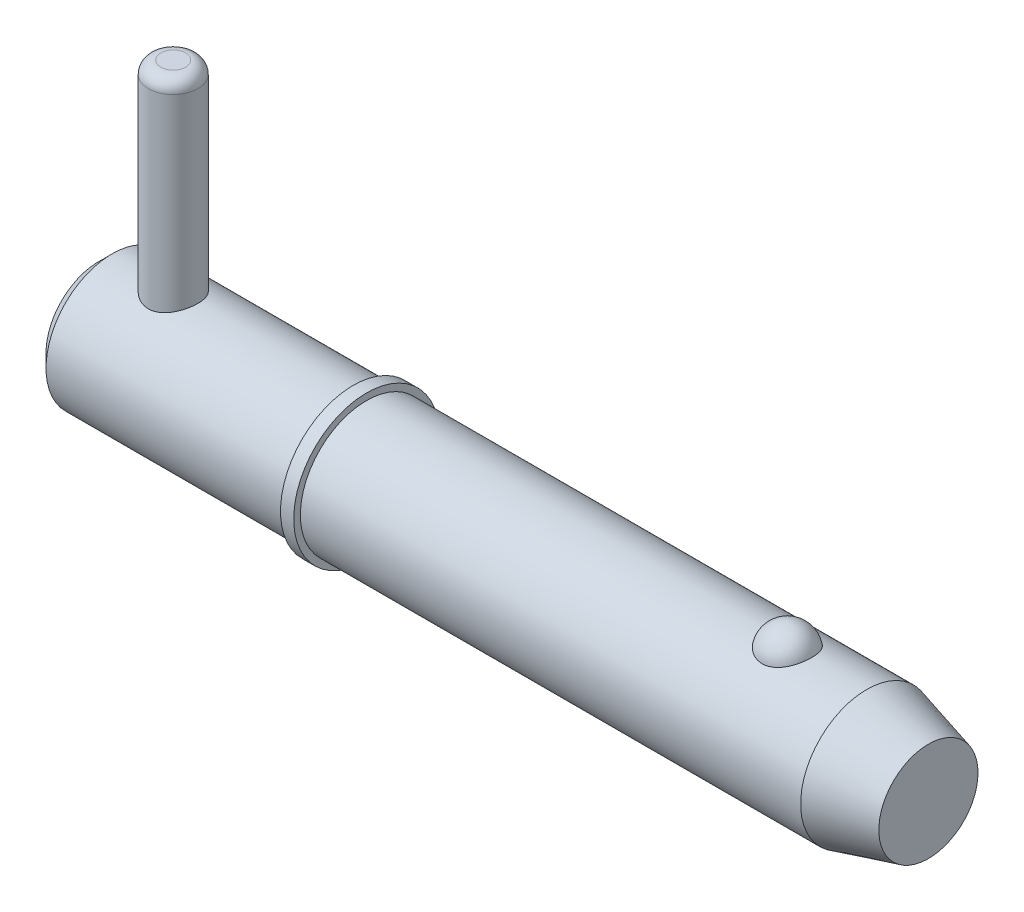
ISO-10303-21;
HEADER;
FILE_DESCRIPTION(('STEP AP214'),'2;1');
FILE_NAME('part.step','',(''),(''),'','','');
FILE_SCHEMA(('AUTOMOTIVE_DESIGN { 1 0 10303 214 1 1 1 1 }'));
ENDSEC;
DATA;
#1=APPLICATION_CONTEXT('core data for automotive mechanical design processes');
#2=APPLICATION_PROTOCOL_DEFINITION('international standard','automotive_design',2000,#1);
#3=PRODUCT_CONTEXT('',#1,'mechanical');
#4=PRODUCT('Part','Part','',(#3));
#5=PRODUCT_RELATED_PRODUCT_CATEGORY('part','',(#4));
#6=PRODUCT_DEFINITION_FORMATION('','',#4);
#7=PRODUCT_DEFINITION_CONTEXT('part definition',#1,'design');
#8=PRODUCT_DEFINITION('design','',#6,#7);
#9=PRODUCT_DEFINITION_SHAPE('','',#8);
#10=(LENGTH_UNIT() NAMED_UNIT(*) SI_UNIT(.MILLI.,.METRE.));
#11=(NAMED_UNIT(*) PLANE_ANGLE_UNIT() SI_UNIT($,.RADIAN.));
#12=(NAMED_UNIT(*) SI_UNIT($,.STERADIAN.) SOLID_ANGLE_UNIT());
#13=UNCERTAINTY_MEASURE_WITH_UNIT(LENGTH_MEASURE(1.E-05),#10,'distance_accuracy_value','');
#14=(GEOMETRIC_REPRESENTATION_CONTEXT(3) GLOBAL_UNCERTAINTY_ASSIGNED_CONTEXT((#13)) GLOBAL_UNIT_ASSIGNED_CONTEXT((#10,
#11,#12)) REPRESENTATION_CONTEXT('',''));
#15=CARTESIAN_POINT('',(0.,0.,0.));
#16=DIRECTION('',(0.,0.,1.));
#17=DIRECTION('',(1.,0.,0.));
#18=AXIS2_PLACEMENT_3D('',#15,#16,#17);
#19=CARTESIAN_POINT('',(7.14,25.4,0.));
#20=DIRECTION('',(0.,-1.,0.));
#21=DIRECTION('',(0.,0.,-1.));
#22=AXIS2_PLACEMENT_3D('',#19,#20,#21);
#23=CYLINDRICAL_SURFACE('',#22,2.38);
#24=CARTESIAN_POINT('',(7.14,-5.16,0.));
#25=DIRECTION('',(0.,1.,0.));
#26=DIRECTION('',(0.,0.,1.));
#27=AXIS2_PLACEMENT_3D('',#24,#25,#26);
#28=CIRCLE('',#27,2.38);
#29=CARTESIAN_POINT('',(7.14,-5.16,2.38));
#30=VERTEX_POINT('',#29);
#31=EDGE_CURVE('P0_E25',#30,#30,#28,.T.);
#32=ORIENTED_EDGE('',*,*,#31,.T.);
#33=EDGE_LOOP('',(#32));
#34=FACE_BOUND('',#33,.T.);
#35=CARTESIAN_POINT('',(7.14,24.21,0.));
#36=DIRECTION('',(0.,1.,0.));
#37=DIRECTION('',(0.,0.,1.));
#38=AXIS2_PLACEMENT_3D('',#35,#36,#37);
#39=CIRCLE('',#38,2.38);
#40=CARTESIAN_POINT('',(7.14,24.21,2.38));
#41=VERTEX_POINT('',#40);
#42=EDGE_CURVE('P0_E29',#41,#41,#39,.F.);
#43=ORIENTED_EDGE('',*,*,#42,.T.);
#44=EDGE_LOOP('',(#43));
#45=FACE_BOUND('',#44,.T.);
#46=ADVANCED_FACE('P0_F14',(#34,#45),#23,.T.);
#47=CARTESIAN_POINT('',(7.14,25.4,0.));
#48=DIRECTION('',(0.,1.,0.));
#49=DIRECTION('',(0.,0.,1.));
#50=AXIS2_PLACEMENT_3D('',#47,#48,#49);
#51=PLANE('',#50);
#52=CARTESIAN_POINT('',(7.14,25.4,0.));
#53=DIRECTION('',(0.,1.,0.));
#54=DIRECTION('',(0.,0.,1.));
#55=AXIS2_PLACEMENT_3D('',#52,#53,#54);
#56=CIRCLE('',#55,1.19);
#57=CARTESIAN_POINT('',(7.14,25.4,1.19));
#58=VERTEX_POINT('',#57);
#59=EDGE_CURVE('P0_E10',#58,#58,#56,.T.);
#60=ORIENTED_EDGE('',*,*,#59,.T.);
#61=EDGE_LOOP('',(#60));
#62=FACE_BOUND('',#61,.T.);
#63=ADVANCED_FACE('P0_F46',(#62),#51,.T.);
#64=CARTESIAN_POINT('',(7.14,-6.35,0.));
#65=DIRECTION('',(0.,1.,0.));
#66=DIRECTION('',(0.,0.,1.));
#67=AXIS2_PLACEMENT_3D('',#64,#65,#66);
#68=PLANE('',#67);
#69=CARTESIAN_POINT('',(7.14,-6.35,0.));
#70=DIRECTION('',(0.,1.,0.));
#71=DIRECTION('',(0.,0.,1.));
#72=AXIS2_PLACEMENT_3D('',#69,#70,#71);
#73=CIRCLE('',#72,1.19);
#74=CARTESIAN_POINT('',(7.14,-6.35,1.19));
#75=VERTEX_POINT('',#74);
#76=EDGE_CURVE('P0_E21',#75,#75,#73,.F.);
#77=ORIENTED_EDGE('',*,*,#76,.T.);
#78=EDGE_LOOP('',(#77));
#79=FACE_BOUND('',#78,.T.);
#80=ADVANCED_FACE('P0_F43',(#79),#68,.F.);
#81=CARTESIAN_POINT('',(7.14,-5.16,0.));
#82=DIRECTION('',(0.,1.,0.));
#83=DIRECTION('',(0.,0.,1.));
#84=AXIS2_PLACEMENT_3D('',#81,#82,#83);
#85=DEGENERATE_TOROIDAL_SURFACE('',#84,1.19,1.19,.T.);
#86=ORIENTED_EDGE('',*,*,#76,.F.);
#87=EDGE_LOOP('',(#86));
#88=FACE_BOUND('',#87,.T.);
#89=ORIENTED_EDGE('',*,*,#31,.F.);
#90=EDGE_LOOP('',(#89));
#91=FACE_BOUND('',#90,.T.);
#92=ADVANCED_FACE('P0_F38',(#88,#91),#85,.T.);
#93=CARTESIAN_POINT('',(7.14,24.21,0.));
#94=DIRECTION('',(0.,1.,0.));
#95=DIRECTION('',(0.,0.,1.));
#96=AXIS2_PLACEMENT_3D('',#93,#94,#95);
#97=DEGENERATE_TOROIDAL_SURFACE('',#96,1.19,1.19,.T.);
#98=ORIENTED_EDGE('',*,*,#42,.F.);
#99=EDGE_LOOP('',(#98));
#100=FACE_BOUND('',#99,.T.);
#101=ORIENTED_EDGE('',*,*,#59,.F.);
#102=EDGE_LOOP('',(#101));
#103=FACE_BOUND('',#102,.T.);
#104=ADVANCED_FACE('P0_F16',(#100,#103),#97,.T.);
#105=CLOSED_SHELL('',(#46,#63,#80,#92,#104));
#106=MANIFOLD_SOLID_BREP('P0_B1',#105);
#107=CARTESIAN_POINT('',(0.,0.,0.));
#108=DIRECTION('',(1.,0.,0.));
#109=DIRECTION('',(0.,0.,-1.));
#110=AXIS2_PLACEMENT_3D('',#107,#108,#109);
#111=CYLINDRICAL_SURFACE('',#110,6.35);
#112=CARTESIAN_POINT('',(73.7553693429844,0.,0.));
#113=DIRECTION('',(1.,0.,0.));
#114=DIRECTION('',(0.,0.,-1.));
#115=AXIS2_PLACEMENT_3D('',#112,#113,#114);
#116=CIRCLE('',#115,6.35);
#117=CARTESIAN_POINT('',(73.7553693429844,0.,-6.35));
#118=VERTEX_POINT('',#117);
#119=EDGE_CURVE('P1_E81',#118,#118,#116,.T.);
#120=ORIENTED_EDGE('',*,*,#119,.F.);
#121=EDGE_LOOP('',(#120));
#122=FACE_BOUND('',#121,.T.);
#123=CARTESIAN_POINT('',(25.7,0.,0.));
#124=DIRECTION('',(1.,0.,0.));
#125=DIRECTION('',(0.,0.,-1.));
#126=AXIS2_PLACEMENT_3D('',#123,#124,#125);
#127=CIRCLE('',#126,6.35);
#128=CARTESIAN_POINT('',(25.7,0.,-6.35));
#129=VERTEX_POINT('',#128);
#130=EDGE_CURVE('P1_E85',#129,#129,#127,.T.);
#131=ORIENTED_EDGE('',*,*,#130,.T.);
#132=EDGE_LOOP('',(#131));
#133=FACE_BOUND('',#132,.T.);
#134=CARTESIAN_POINT('',(66.1300214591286,5.87502187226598,2.40969251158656));
#135=CARTESIAN_POINT('',(66.0050305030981,5.87501645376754,2.40969773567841));
#136=CARTESIAN_POINT('',(65.8800806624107,5.87916061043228,2.39967292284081));
#137=CARTESIAN_POINT('',(65.6339091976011,5.89523112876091,2.35991730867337));
#138=CARTESIAN_POINT('',(65.5126863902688,5.90715499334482,2.33019283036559));
#139=CARTESIAN_POINT('',(65.2775170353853,5.9373956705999,2.25201402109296));
#140=CARTESIAN_POINT('',(65.1635602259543,5.95570321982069,2.20358681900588));
#141=CARTESIAN_POINT('',(64.94557352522,5.99672067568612,2.08937987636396));
#142=CARTESIAN_POINT('',(64.8415457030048,6.01943149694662,2.02359652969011));
#143=CARTESIAN_POINT('',(64.6429437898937,6.06760647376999,1.87428969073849));
#144=CARTESIAN_POINT('',(64.5487268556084,6.09313095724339,1.79031110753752));
#145=CARTESIAN_POINT('',(64.3752557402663,6.14375873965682,1.60800178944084));
#146=CARTESIAN_POINT('',(64.2960043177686,6.16886196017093,1.50966841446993));
#147=CARTESIAN_POINT('',(64.1508457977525,6.2172460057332,1.29645884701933));
#148=CARTESIAN_POINT('',(64.0856885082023,6.24039621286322,1.18104158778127));
#149=CARTESIAN_POINT('',(63.9747035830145,6.28117277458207,0.940351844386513));
#150=CARTESIAN_POINT('',(63.9288776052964,6.29879865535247,0.815078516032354));
#151=CARTESIAN_POINT('',(63.8570234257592,6.32692073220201,0.556494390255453));
#152=CARTESIAN_POINT('',(63.831249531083,6.33732517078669,0.423102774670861));
#153=CARTESIAN_POINT('',(63.8009885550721,6.34957673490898,0.153542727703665));
#154=CARTESIAN_POINT('',(63.7965009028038,6.35142408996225,0.017374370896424));
#155=CARTESIAN_POINT('',(63.8088655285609,6.34638925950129,-0.253036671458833));
#156=CARTESIAN_POINT('',(63.8255949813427,6.33955731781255,-0.387285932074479));
#157=CARTESIAN_POINT('',(63.879843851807,6.31794129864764,-0.650851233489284));
#158=CARTESIAN_POINT('',(63.9173636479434,6.30315707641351,-0.7801671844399));
#159=CARTESIAN_POINT('',(64.012500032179,6.26711642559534,-1.03041949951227));
#160=CARTESIAN_POINT('',(64.070143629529,6.24585130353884,-1.1513443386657));
#161=CARTESIAN_POINT('',(64.2043522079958,6.19905619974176,-1.38129800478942));
#162=CARTESIAN_POINT('',(64.2809187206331,6.17352587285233,-1.49032586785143));
#163=CARTESIAN_POINT('',(64.4517538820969,6.12080227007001,-1.69393164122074));
#164=CARTESIAN_POINT('',(64.5461008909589,6.09360200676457,-1.78844209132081));
#165=CARTESIAN_POINT('',(64.7501196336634,6.0407043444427,-1.95970536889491));
#166=CARTESIAN_POINT('',(64.8597900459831,6.01500681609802,-2.03645972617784));
#167=CARTESIAN_POINT('',(65.0891876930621,5.96867714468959,-2.16845644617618));
#168=CARTESIAN_POINT('',(65.2086522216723,5.94794910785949,-2.22412062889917));
#169=CARTESIAN_POINT('',(65.4562188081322,5.91340580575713,-2.31440992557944));
#170=CARTESIAN_POINT('',(65.5843175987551,5.89958794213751,-2.34904294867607));
#171=CARTESIAN_POINT('',(65.838582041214,5.88111049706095,-2.39491590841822));
#172=CARTESIAN_POINT('',(65.9645207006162,5.87602512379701,-2.40724512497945));
#173=CARTESIAN_POINT('',(66.2167867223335,5.87428980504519,-2.41147867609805));
#174=CARTESIAN_POINT('',(66.343114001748,5.87763817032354,-2.40338710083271));
#175=CARTESIAN_POINT('',(66.5884170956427,5.89212921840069,-2.36762715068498));
#176=CARTESIAN_POINT('',(66.7074992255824,5.90302431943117,-2.34058030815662));
#177=CARTESIAN_POINT('',(66.9392447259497,5.93113752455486,-2.2683906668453));
#178=CARTESIAN_POINT('',(67.0519075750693,5.94835614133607,-2.22324640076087));
#179=CARTESIAN_POINT('',(67.2704009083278,5.98773016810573,-2.11493806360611));
#180=CARTESIAN_POINT('',(67.376028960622,6.00998499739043,-2.05140269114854));
#181=CARTESIAN_POINT('',(67.5753006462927,6.0569014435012,-1.90842705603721));
#182=CARTESIAN_POINT('',(67.6689415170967,6.08156361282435,-1.82898313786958));
#183=CARTESIAN_POINT('',(67.8466754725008,6.13211715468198,-1.6518242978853));
#184=CARTESIAN_POINT('',(67.930055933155,6.15800825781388,-1.55339381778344));
#185=CARTESIAN_POINT('',(68.0797900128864,6.20712834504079,-1.34374214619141));
#186=CARTESIAN_POINT('',(68.1461405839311,6.23035685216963,-1.23251867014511));
#187=CARTESIAN_POINT('',(68.2623455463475,6.27251177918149,-0.996447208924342));
#188=CARTESIAN_POINT('',(68.3116072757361,6.29127762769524,-0.8712781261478));
#189=CARTESIAN_POINT('',(68.3896142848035,6.3215862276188,-0.613870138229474));
#190=CARTESIAN_POINT('',(68.4183593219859,6.33312889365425,-0.481631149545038));
#191=CARTESIAN_POINT('',(68.4547705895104,6.34782349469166,-0.213672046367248));
#192=CARTESIAN_POINT('',(68.4624134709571,6.35096613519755,-0.077948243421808));
#193=CARTESIAN_POINT('',(68.4563951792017,6.34851322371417,0.192943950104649));
#194=CARTESIAN_POINT('',(68.4427343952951,6.3429178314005,0.328112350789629));
#195=CARTESIAN_POINT('',(68.3945036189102,6.32360512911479,0.593406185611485));
#196=CARTESIAN_POINT('',(68.3600313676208,6.30992579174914,0.723552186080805));
#197=CARTESIAN_POINT('',(68.2709539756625,6.27586325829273,0.975834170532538));
#198=CARTESIAN_POINT('',(68.2163476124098,6.25547965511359,1.09796966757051));
#199=CARTESIAN_POINT('',(68.0877587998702,6.20998183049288,1.33148921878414));
#200=CARTESIAN_POINT('',(68.0136742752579,6.18484288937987,1.44281227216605));
#201=CARTESIAN_POINT('',(67.8478204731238,6.13258735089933,1.65087683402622));
#202=CARTESIAN_POINT('',(67.7560515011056,6.10547078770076,1.74761859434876));
#203=CARTESIAN_POINT('',(67.5571839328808,6.05235879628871,1.92350926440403));
#204=CARTESIAN_POINT('',(67.450133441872,6.02636017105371,2.00271146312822));
#205=CARTESIAN_POINT('',(67.2231384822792,5.97843747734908,2.14154159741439));
#206=CARTESIAN_POINT('',(67.103191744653,5.95651412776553,2.2011660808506));
#207=CARTESIAN_POINT('',(66.8445236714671,5.91812106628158,2.30250570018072));
#208=CARTESIAN_POINT('',(66.7050698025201,5.90217533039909,2.34256795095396));
#209=CARTESIAN_POINT('',(66.4203974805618,5.88063128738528,2.39615214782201));
#210=CARTESIAN_POINT('',(66.2751817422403,5.87502816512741,2.40968644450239));
#211=CARTESIAN_POINT('',(66.1300214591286,5.87502187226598,2.40969251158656));
#212=B_SPLINE_CURVE_WITH_KNOTS('',3,(#134,#135,#136,#137,#138,#139,#140,#141,#142,#143,#144,
#145,#146,#147,#148,#149,#150,#151,#152,#153,#154,#155,#156,#157,#158,#159,#160,#161,#162,#163,
#164,#165,#166,#167,#168,#169,#170,#171,#172,#173,#174,#175,#176,#177,#178,#179,#180,#181,#182,
#183,#184,#185,#186,#187,#188,#189,#190,#191,#192,#193,#194,#195,#196,#197,#198,#199,#200,#201,
#202,#203,#204,#205,#206,#207,#208,#209,#210,#211),.UNSPECIFIED.,.T.,.F.,(4,2,2,2,2,2,2,2,2,2,2,
2,2,2,2,2,2,2,2,2,2,2,2,2,2,2,2,2,2,2,2,2,2,2,2,2,2,2,4),(0.,0.374440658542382,
0.748761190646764,1.12254078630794,1.49639810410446,1.88098871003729,2.26565013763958,
2.66741104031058,3.0692063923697,3.47601794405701,3.88281858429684,4.28727498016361,
4.69173873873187,5.09674745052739,5.50178895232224,5.90865911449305,6.31549420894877,
6.71369855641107,7.11175305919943,7.48978077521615,7.86773278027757,8.23383886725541,
8.59997464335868,8.97409044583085,9.34829231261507,9.74122667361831,10.1342313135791,
10.539752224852,10.945277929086,11.3512521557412,11.7572189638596,12.1612938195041,
12.5653932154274,12.9716540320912,13.37790783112,13.782909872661,14.1879832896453,
14.6230486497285,15.0579114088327),.UNSPECIFIED.);
#213=CARTESIAN_POINT('',(66.1300214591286,5.87502187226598,2.40969251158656));
#214=VERTEX_POINT('',#213);
#215=EDGE_CURVE('P1_E35',#214,#214,#212,.T.);
#216=ORIENTED_EDGE('',*,*,#215,.T.);
#217=EDGE_LOOP('',(#216));
#218=FACE_BOUND('',#217,.T.);
#219=ADVANCED_FACE('P1_F13',(#122,#133,#218),#111,.T.);
#220=CARTESIAN_POINT('',(0.,0.,0.));
#221=DIRECTION('',(-1.,0.,0.));
#222=DIRECTION('',(0.,0.,1.));
#223=AXIS2_PLACEMENT_3D('',#220,#221,#222);
#224=PLANE('',#223);
#225=CARTESIAN_POINT('',(0.,0.,0.));
#226=DIRECTION('',(1.,0.,0.));
#227=DIRECTION('',(0.,0.,-1.));
#228=AXIS2_PLACEMENT_3D('',#225,#226,#227);
#229=CIRCLE('',#228,5.08);
#230=CARTESIAN_POINT('',(0.,0.,-5.08));
#231=VERTEX_POINT('',#230);
#232=EDGE_CURVE('P1_E9',#231,#231,#229,.T.);
#233=ORIENTED_EDGE('',*,*,#232,.F.);
#234=EDGE_LOOP('',(#233));
#235=FACE_BOUND('',#234,.T.);
#236=ADVANCED_FACE('P1_F15',(#235),#224,.T.);
#237=CARTESIAN_POINT('',(1.27,0.,0.));
#238=DIRECTION('',(1.,0.,0.));
#239=DIRECTION('',(0.,0.,-1.));
#240=AXIS2_PLACEMENT_3D('',#237,#238,#239);
#241=CONICAL_SURFACE('',#240,6.35,0.78539816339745);
#242=ORIENTED_EDGE('',*,*,#232,.T.);
#243=EDGE_LOOP('',(#242));
#244=FACE_BOUND('',#243,.T.);
#245=CARTESIAN_POINT('',(1.27,0.,0.));
#246=DIRECTION('',(1.,0.,0.));
#247=DIRECTION('',(0.,0.,-1.));
#248=AXIS2_PLACEMENT_3D('',#245,#246,#247);
#249=CIRCLE('',#248,6.35);
#250=CARTESIAN_POINT('',(1.27,0.,-6.35));
#251=VERTEX_POINT('',#250);
#252=EDGE_CURVE('P1_E26',#251,#251,#249,.T.);
#253=ORIENTED_EDGE('',*,*,#252,.F.);
#254=EDGE_LOOP('',(#253));
#255=FACE_BOUND('',#254,.T.);
#256=ADVANCED_FACE('P1_F77',(#244,#255),#241,.T.);
#257=CARTESIAN_POINT('',(0.,0.,0.));
#258=DIRECTION('',(1.,0.,0.));
#259=DIRECTION('',(0.,0.,-1.));
#260=AXIS2_PLACEMENT_3D('',#257,#258,#259);
#261=CYLINDRICAL_SURFACE('',#260,6.35);
#262=CARTESIAN_POINT('',(7.14,-5.88711304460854,2.38));
#263=CARTESIAN_POINT('',(7.01146258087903,-5.88710856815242,2.38000480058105));
#264=CARTESIAN_POINT('',(6.88295682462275,-5.89136840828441,2.36955244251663));
#265=CARTESIAN_POINT('',(6.62981934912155,-5.90782785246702,2.32820953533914));
#266=CARTESIAN_POINT('',(6.50518751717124,-5.92002722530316,2.29731958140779));
#267=CARTESIAN_POINT('',(6.26352403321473,-5.95079384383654,2.21639366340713));
#268=CARTESIAN_POINT('',(6.14647496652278,-5.96934583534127,2.16640353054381));
#269=CARTESIAN_POINT('',(5.92237941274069,-6.01070278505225,2.04885862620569));
#270=CARTESIAN_POINT('',(5.81533593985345,-6.03350901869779,1.98129858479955));
#271=CARTESIAN_POINT('',(5.60897525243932,-6.08207341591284,1.82693902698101));
#272=CARTESIAN_POINT('',(5.51022503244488,-6.10791836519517,1.73940861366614));
#273=CARTESIAN_POINT('',(5.32840561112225,-6.15892405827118,1.54914379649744));
#274=CARTESIAN_POINT('',(5.24533975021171,-6.1840846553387,1.44640616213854));
#275=CARTESIAN_POINT('',(5.09451639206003,-6.23191821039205,1.22434014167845));
#276=CARTESIAN_POINT('',(5.02737511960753,-6.25447755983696,1.10456656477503));
#277=CARTESIAN_POINT('',(4.91443001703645,-6.2935236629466,0.854429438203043));
#278=CARTESIAN_POINT('',(4.86861879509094,-6.31001251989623,0.724069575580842));
#279=CARTESIAN_POINT('',(4.80162253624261,-6.33444370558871,0.46242122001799));
#280=CARTESIAN_POINT('',(4.77946137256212,-6.34272370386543,0.331414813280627));
#281=CARTESIAN_POINT('',(4.75726677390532,-6.35101600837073,0.0672982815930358));
#282=CARTESIAN_POINT('',(4.75722615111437,-6.35103100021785,-0.0658111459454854));
#283=CARTESIAN_POINT('',(4.77870510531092,-6.3430064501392,-0.323358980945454));
#284=CARTESIAN_POINT('',(4.79915922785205,-6.33536494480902,-0.447900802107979));
#285=CARTESIAN_POINT('',(4.85925493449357,-6.31340794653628,-0.69163609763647));
#286=CARTESIAN_POINT('',(4.89889787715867,-6.29909198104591,-0.810829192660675));
#287=CARTESIAN_POINT('',(4.9967414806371,-6.26494471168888,-1.04254212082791));
#288=CARTESIAN_POINT('',(5.05520370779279,-6.24503620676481,-1.1549396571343));
#289=CARTESIAN_POINT('',(5.1887948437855,-6.20171869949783,-1.3686079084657));
#290=CARTESIAN_POINT('',(5.26392912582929,-6.17830856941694,-1.46987502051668));
#291=CARTESIAN_POINT('',(5.43386591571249,-6.12878580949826,-1.66468415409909));
#292=CARTESIAN_POINT('',(5.52956139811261,-6.10259519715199,-1.75742857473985));
#293=CARTESIAN_POINT('',(5.73530435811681,-6.05155777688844,-1.92585331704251));
#294=CARTESIAN_POINT('',(5.84535542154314,-6.02671130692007,-2.00152936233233));
#295=CARTESIAN_POINT('',(6.07982989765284,-5.98068420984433,-2.13519109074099));
#296=CARTESIAN_POINT('',(6.20451768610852,-5.95959698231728,-2.19274775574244));
#297=CARTESIAN_POINT('',(6.4628145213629,-5.92455622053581,-2.28574558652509));
#298=CARTESIAN_POINT('',(6.59641856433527,-5.91059872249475,-2.32119904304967));
#299=CARTESIAN_POINT('',(6.86087441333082,-5.8923327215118,-2.36717069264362));
#300=CARTESIAN_POINT('',(6.99147192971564,-5.8875347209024,-2.37895573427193));
#301=CARTESIAN_POINT('',(7.25283805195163,-5.88674545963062,-2.38091046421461));
#302=CARTESIAN_POINT('',(7.38360660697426,-5.89075200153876,-2.37108554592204));
#303=CARTESIAN_POINT('',(7.63510696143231,-5.90662331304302,-2.33124781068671));
#304=CARTESIAN_POINT('',(7.75602069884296,-5.91810660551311,-2.30221396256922));
#305=CARTESIAN_POINT('',(7.99120505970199,-5.94718527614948,-2.22601401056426));
#306=CARTESIAN_POINT('',(8.10547431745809,-5.96478190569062,-2.17884419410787));
#307=CARTESIAN_POINT('',(8.32888632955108,-6.00491533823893,-2.06572311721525));
#308=CARTESIAN_POINT('',(8.43767672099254,-6.02761250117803,-1.99913452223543));
#309=CARTESIAN_POINT('',(8.6429894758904,-6.07511988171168,-1.84974438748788));
#310=CARTESIAN_POINT('',(8.73950733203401,-6.09993087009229,-1.76693691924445));
#311=CARTESIAN_POINT('',(8.9238741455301,-6.1507686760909,-1.58125563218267));
#312=CARTESIAN_POINT('',(9.01078732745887,-6.17677301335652,-1.47744327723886));
#313=CARTESIAN_POINT('',(9.16607127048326,-6.22556172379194,-1.25606967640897));
#314=CARTESIAN_POINT('',(9.23444197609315,-6.24834608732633,-1.13850838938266));
#315=CARTESIAN_POINT('',(9.3502493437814,-6.28811144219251,-0.893050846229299));
#316=CARTESIAN_POINT('',(9.39775808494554,-6.30511236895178,-0.765192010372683));
#317=CARTESIAN_POINT('',(9.47032640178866,-6.33145833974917,-0.502514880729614));
#318=CARTESIAN_POINT('',(9.49539651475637,-6.34080697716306,-0.367699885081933));
#319=CARTESIAN_POINT('',(9.52124059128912,-6.35045496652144,-0.103396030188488));
#320=CARTESIAN_POINT('',(9.52334421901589,-6.35124952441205,0.025945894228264));
#321=CARTESIAN_POINT('',(9.50661518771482,-6.34499064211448,0.283061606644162));
#322=CARTESIAN_POINT('',(9.48778504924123,-6.33793814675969,0.410835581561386));
#323=CARTESIAN_POINT('',(9.43065630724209,-6.31700307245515,0.658028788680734));
#324=CARTESIAN_POINT('',(9.39284291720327,-6.30329098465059,0.7775756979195));
#325=CARTESIAN_POINT('',(9.29930406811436,-6.27046903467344,1.00863789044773));
#326=CARTESIAN_POINT('',(9.2435752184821,-6.25135815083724,1.12015164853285));
#327=CARTESIAN_POINT('',(9.11312349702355,-6.20865254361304,1.33711407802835));
#328=CARTESIAN_POINT('',(9.03770094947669,-6.18490316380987,1.44211105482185));
#329=CARTESIAN_POINT('',(8.87110640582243,-6.13583718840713,1.63836897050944));
#330=CARTESIAN_POINT('',(8.77992879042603,-6.11052003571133,1.72962498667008));
#331=CARTESIAN_POINT('',(8.57869799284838,-6.05953829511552,1.90076098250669));
#332=CARTESIAN_POINT('',(8.46790320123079,-6.03392573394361,1.97978778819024));
#333=CARTESIAN_POINT('',(8.23379693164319,-5.98676607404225,2.11813466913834));
#334=CARTESIAN_POINT('',(8.11048418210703,-5.9652193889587,2.17745273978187));
#335=CARTESIAN_POINT('',(7.84900037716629,-5.92818393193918,2.27641807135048));
#336=CARTESIAN_POINT('',(7.71041678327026,-5.91299857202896,2.31510015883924));
#337=CARTESIAN_POINT('',(7.42787316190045,-5.89246887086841,2.36688002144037));
#338=CARTESIAN_POINT('',(7.28391673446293,-5.88711805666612,2.37999462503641));
#339=CARTESIAN_POINT('',(7.14,-5.88711304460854,2.38));
#340=B_SPLINE_CURVE_WITH_KNOTS('',3,(#262,#263,#264,#265,#266,#267,#268,#269,#270,#271,#272,
#273,#274,#275,#276,#277,#278,#279,#280,#281,#282,#283,#284,#285,#286,#287,#288,#289,#290,#291,
#292,#293,#294,#295,#296,#297,#298,#299,#300,#301,#302,#303,#304,#305,#306,#307,#308,#309,#310,
#311,#312,#313,#314,#315,#316,#317,#318,#319,#320,#321,#322,#323,#324,#325,#326,#327,#328,#329,
#330,#331,#332,#333,#334,#335,#336,#337,#338,#339),.UNSPECIFIED.,.T.,.F.,(4,2,2,2,2,2,2,2,2,2,2,
2,2,2,2,2,2,2,2,2,2,2,2,2,2,2,2,2,2,2,2,2,2,2,2,2,2,2,4),(0.,0.385076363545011,
0.770141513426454,1.15428843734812,1.53855071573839,1.94016118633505,2.3418570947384,
2.75720522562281,3.1724093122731,3.569721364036,3.96690431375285,4.34445758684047,
4.72203759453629,5.10511017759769,5.48830640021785,5.89390240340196,6.29959991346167,
6.71428455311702,7.12873839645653,7.52034494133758,7.91185376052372,8.28480528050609,
8.65783318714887,9.0448340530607,9.43197664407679,9.84363087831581,10.2552863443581,
10.6655081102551,11.0755371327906,11.4616919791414,11.847800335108,12.224507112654,
12.6012852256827,12.9938941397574,13.386643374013,13.8000944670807,14.2135876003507,
14.6450218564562,15.0761720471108),.UNSPECIFIED.);
#341=CARTESIAN_POINT('',(7.14,-5.88711304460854,2.38));
#342=VERTEX_POINT('',#341);
#343=EDGE_CURVE('P1_E17',#342,#342,#340,.T.);
#344=ORIENTED_EDGE('',*,*,#343,.F.);
#345=EDGE_LOOP('',(#344));
#346=FACE_BOUND('',#345,.T.);
#347=CARTESIAN_POINT('',(7.14,5.88711304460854,2.38));
#348=CARTESIAN_POINT('',(7.26853741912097,5.88710856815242,2.38000480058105));
#349=CARTESIAN_POINT('',(7.39704317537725,5.89136840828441,2.36955244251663));
#350=CARTESIAN_POINT('',(7.65018065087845,5.90782785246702,2.32820953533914));
#351=CARTESIAN_POINT('',(7.77481248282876,5.92002722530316,2.29731958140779));
#352=CARTESIAN_POINT('',(8.01647596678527,5.95079384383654,2.21639366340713));
#353=CARTESIAN_POINT('',(8.13352503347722,5.96934583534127,2.16640353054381));
#354=CARTESIAN_POINT('',(8.35762058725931,6.01070278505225,2.04885862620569));
#355=CARTESIAN_POINT('',(8.46466406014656,6.03350901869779,1.98129858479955));
#356=CARTESIAN_POINT('',(8.67102474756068,6.08207341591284,1.82693902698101));
#357=CARTESIAN_POINT('',(8.76977496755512,6.10791836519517,1.73940861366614));
#358=CARTESIAN_POINT('',(8.95159438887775,6.15892405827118,1.54914379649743));
#359=CARTESIAN_POINT('',(9.03466024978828,6.1840846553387,1.44640616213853));
#360=CARTESIAN_POINT('',(9.18548360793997,6.23191821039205,1.22434014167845));
#361=CARTESIAN_POINT('',(9.25262488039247,6.25447755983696,1.10456656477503));
#362=CARTESIAN_POINT('',(9.36556998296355,6.2935236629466,0.854429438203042));
#363=CARTESIAN_POINT('',(9.41138120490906,6.31001251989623,0.72406957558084));
#364=CARTESIAN_POINT('',(9.47837746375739,6.33444370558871,0.462421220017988));
#365=CARTESIAN_POINT('',(9.50053862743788,6.34272370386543,0.331414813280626));
#366=CARTESIAN_POINT('',(9.52273322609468,6.35101600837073,0.0672982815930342));
#367=CARTESIAN_POINT('',(9.52277384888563,6.35103100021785,-0.0658111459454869));
#368=CARTESIAN_POINT('',(9.50129489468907,6.3430064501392,-0.323358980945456));
#369=CARTESIAN_POINT('',(9.48084077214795,6.33536494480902,-0.447900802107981));
#370=CARTESIAN_POINT('',(9.42074506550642,6.31340794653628,-0.691636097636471));
#371=CARTESIAN_POINT('',(9.38110212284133,6.29909198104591,-0.810829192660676));
#372=CARTESIAN_POINT('',(9.2832585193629,6.26494471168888,-1.04254212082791));
#373=CARTESIAN_POINT('',(9.22479629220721,6.24503620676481,-1.1549396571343));
#374=CARTESIAN_POINT('',(9.0912051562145,6.20171869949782,-1.3686079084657));
#375=CARTESIAN_POINT('',(9.0160708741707,6.17830856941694,-1.46987502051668));
#376=CARTESIAN_POINT('',(8.84613408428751,6.12878580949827,-1.66468415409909));
#377=CARTESIAN_POINT('',(8.75043860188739,6.10259519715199,-1.75742857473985));
#378=CARTESIAN_POINT('',(8.54469564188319,6.05155777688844,-1.92585331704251));
#379=CARTESIAN_POINT('',(8.43464457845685,6.02671130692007,-2.00152936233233));
#380=CARTESIAN_POINT('',(8.20017010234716,5.98068420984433,-2.13519109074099));
#381=CARTESIAN_POINT('',(8.07548231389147,5.95959698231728,-2.19274775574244));
#382=CARTESIAN_POINT('',(7.8171854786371,5.9245562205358,-2.28574558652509));
#383=CARTESIAN_POINT('',(7.68358143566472,5.91059872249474,-2.32119904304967));
#384=CARTESIAN_POINT('',(7.41912558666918,5.8923327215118,-2.36717069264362));
#385=CARTESIAN_POINT('',(7.28852807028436,5.8875347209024,-2.37895573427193));
#386=CARTESIAN_POINT('',(7.02716194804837,5.88674545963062,-2.38091046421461));
#387=CARTESIAN_POINT('',(6.89639339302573,5.89075200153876,-2.37108554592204));
#388=CARTESIAN_POINT('',(6.64489303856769,5.90662331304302,-2.33124781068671));
#389=CARTESIAN_POINT('',(6.52397930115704,5.91810660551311,-2.30221396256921));
#390=CARTESIAN_POINT('',(6.288794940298,5.94718527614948,-2.22601401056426));
#391=CARTESIAN_POINT('',(6.17452568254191,5.96478190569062,-2.17884419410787));
#392=CARTESIAN_POINT('',(5.95111367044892,6.00491533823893,-2.06572311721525));
#393=CARTESIAN_POINT('',(5.84232327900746,6.02761250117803,-1.99913452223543));
#394=CARTESIAN_POINT('',(5.6370105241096,6.07511988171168,-1.84974438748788));
#395=CARTESIAN_POINT('',(5.54049266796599,6.09993087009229,-1.76693691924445));
#396=CARTESIAN_POINT('',(5.3561258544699,6.1507686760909,-1.58125563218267));
#397=CARTESIAN_POINT('',(5.26921267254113,6.17677301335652,-1.47744327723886));
#398=CARTESIAN_POINT('',(5.11392872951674,6.22556172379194,-1.25606967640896));
#399=CARTESIAN_POINT('',(5.04555802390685,6.24834608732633,-1.13850838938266));
#400=CARTESIAN_POINT('',(4.9297506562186,6.28811144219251,-0.893050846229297));
#401=CARTESIAN_POINT('',(4.88224191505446,6.30511236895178,-0.76519201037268));
#402=CARTESIAN_POINT('',(4.80967359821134,6.33145833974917,-0.502514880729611));
#403=CARTESIAN_POINT('',(4.78460348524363,6.34080697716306,-0.36769988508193));
#404=CARTESIAN_POINT('',(4.75875940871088,6.35045496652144,-0.103396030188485));
#405=CARTESIAN_POINT('',(4.75665578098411,6.35124952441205,0.025945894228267));
#406=CARTESIAN_POINT('',(4.77338481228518,6.34499064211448,0.283061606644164));
#407=CARTESIAN_POINT('',(4.79221495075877,6.33793814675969,0.410835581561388));
#408=CARTESIAN_POINT('',(4.84934369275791,6.31700307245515,0.658028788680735));
#409=CARTESIAN_POINT('',(4.88715708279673,6.30329098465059,0.777575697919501));
#410=CARTESIAN_POINT('',(4.98069593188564,6.27046903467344,1.00863789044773));
#411=CARTESIAN_POINT('',(5.0364247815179,6.25135815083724,1.12015164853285));
#412=CARTESIAN_POINT('',(5.16687650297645,6.20865254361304,1.33711407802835));
#413=CARTESIAN_POINT('',(5.24229905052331,6.18490316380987,1.44211105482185));
#414=CARTESIAN_POINT('',(5.40889359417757,6.13583718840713,1.63836897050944));
#415=CARTESIAN_POINT('',(5.50007120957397,6.11052003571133,1.72962498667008));
#416=CARTESIAN_POINT('',(5.70130200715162,6.05953829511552,1.90076098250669));
#417=CARTESIAN_POINT('',(5.81209679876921,6.03392573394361,1.97978778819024));
#418=CARTESIAN_POINT('',(6.04620306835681,5.98676607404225,2.11813466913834));
#419=CARTESIAN_POINT('',(6.16951581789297,5.9652193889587,2.17745273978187));
#420=CARTESIAN_POINT('',(6.43099962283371,5.92818393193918,2.27641807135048));
#421=CARTESIAN_POINT('',(6.56958321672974,5.91299857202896,2.31510015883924));
#422=CARTESIAN_POINT('',(6.85212683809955,5.89246887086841,2.36688002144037));
#423=CARTESIAN_POINT('',(6.99608326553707,5.88711805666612,2.37999462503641));
#424=CARTESIAN_POINT('',(7.14,5.88711304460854,2.38));
#425=B_SPLINE_CURVE_WITH_KNOTS('',3,(#347,#348,#349,#350,#351,#352,#353,#354,#355,#356,#357,
#358,#359,#360,#361,#362,#363,#364,#365,#366,#367,#368,#369,#370,#371,#372,#373,#374,#375,#376,
#377,#378,#379,#380,#381,#382,#383,#384,#385,#386,#387,#388,#389,#390,#391,#392,#393,#394,#395,
#396,#397,#398,#399,#400,#401,#402,#403,#404,#405,#406,#407,#408,#409,#410,#411,#412,#413,#414,
#415,#416,#417,#418,#419,#420,#421,#422,#423,#424),.UNSPECIFIED.,.T.,.F.,(4,2,2,2,2,2,2,2,2,2,2,
2,2,2,2,2,2,2,2,2,2,2,2,2,2,2,2,2,2,2,2,2,2,2,2,2,2,2,4),(0.,0.385076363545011,
0.770141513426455,1.15428843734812,1.53855071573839,1.94016118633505,2.3418570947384,
2.75720522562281,3.1724093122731,3.56972136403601,3.96690431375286,4.34445758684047,
4.72203759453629,5.10511017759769,5.48830640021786,5.89390240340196,6.29959991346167,
6.71428455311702,7.12873839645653,7.52034494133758,7.91185376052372,8.2848052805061,
8.65783318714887,9.0448340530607,9.43197664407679,9.84363087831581,10.2552863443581,
10.6655081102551,11.0755371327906,11.4616919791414,11.847800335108,12.2245071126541,
12.6012852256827,12.9938941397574,13.386643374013,13.8000944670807,14.2135876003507,
14.6450218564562,15.0761720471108),.UNSPECIFIED.);
#426=CARTESIAN_POINT('',(7.14,5.88711304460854,2.38));
#427=VERTEX_POINT('',#426);
#428=EDGE_CURVE('P1_E43',#427,#427,#425,.T.);
#429=ORIENTED_EDGE('',*,*,#428,.F.);
#430=EDGE_LOOP('',(#429));
#431=FACE_BOUND('',#430,.T.);
#432=ORIENTED_EDGE('',*,*,#252,.T.);
#433=EDGE_LOOP('',(#432));
#434=FACE_BOUND('',#433,.T.);
#435=CARTESIAN_POINT('',(24.43,0.,0.));
#436=DIRECTION('',(1.,0.,0.));
#437=DIRECTION('',(0.,0.,-1.));
#438=AXIS2_PLACEMENT_3D('',#435,#436,#437);
#439=CIRCLE('',#438,6.35);
#440=CARTESIAN_POINT('',(24.43,0.,-6.35));
#441=VERTEX_POINT('',#440);
#442=EDGE_CURVE('P1_E31',#441,#441,#439,.T.);
#443=ORIENTED_EDGE('',*,*,#442,.F.);
#444=EDGE_LOOP('',(#443));
#445=FACE_BOUND('',#444,.T.);
#446=ADVANCED_FACE('P1_F103',(#346,#431,#434,#445),#261,.T.);
#447=CARTESIAN_POINT('',(24.43,6.35,0.));
#448=DIRECTION('',(-1.,0.,0.));
#449=DIRECTION('',(0.,0.,1.));
#450=AXIS2_PLACEMENT_3D('',#447,#448,#449);
#451=PLANE('',#450);
#452=ORIENTED_EDGE('',*,*,#442,.T.);
#453=EDGE_LOOP('',(#452));
#454=FACE_BOUND('',#453,.T.);
#455=CARTESIAN_POINT('',(24.43,0.,0.));
#456=DIRECTION('',(1.,0.,0.));
#457=DIRECTION('',(0.,0.,-1.));
#458=AXIS2_PLACEMENT_3D('',#455,#456,#457);
#459=CIRCLE('',#458,6.985);
#460=CARTESIAN_POINT('',(24.43,0.,-6.985));
#461=VERTEX_POINT('',#460);
#462=EDGE_CURVE('P1_E91',#461,#461,#459,.T.);
#463=ORIENTED_EDGE('',*,*,#462,.F.);
#464=EDGE_LOOP('',(#463));
#465=FACE_BOUND('',#464,.T.);
#466=ADVANCED_FACE('P1_F100',(#454,#465),#451,.T.);
#467=CARTESIAN_POINT('',(0.,0.,0.));
#468=DIRECTION('',(1.,0.,0.));
#469=DIRECTION('',(0.,0.,-1.));
#470=AXIS2_PLACEMENT_3D('',#467,#468,#469);
#471=CYLINDRICAL_SURFACE('',#470,6.985);
#472=ORIENTED_EDGE('',*,*,#462,.T.);
#473=EDGE_LOOP('',(#472));
#474=FACE_BOUND('',#473,.T.);
#475=CARTESIAN_POINT('',(25.7,0.,0.));
#476=DIRECTION('',(1.,0.,0.));
#477=DIRECTION('',(0.,0.,-1.));
#478=AXIS2_PLACEMENT_3D('',#475,#476,#477);
#479=CIRCLE('',#478,6.985);
#480=CARTESIAN_POINT('',(25.7,0.,-6.985));
#481=VERTEX_POINT('',#480);
#482=EDGE_CURVE('P1_E88',#481,#481,#479,.T.);
#483=ORIENTED_EDGE('',*,*,#482,.F.);
#484=EDGE_LOOP('',(#483));
#485=FACE_BOUND('',#484,.T.);
#486=ADVANCED_FACE('P1_F68',(#474,#485),#471,.T.);
#487=CARTESIAN_POINT('',(25.7,6.985,0.));
#488=DIRECTION('',(1.,0.,0.));
#489=DIRECTION('',(0.,0.,-1.));
#490=AXIS2_PLACEMENT_3D('',#487,#488,#489);
#491=PLANE('',#490);
#492=ORIENTED_EDGE('',*,*,#482,.T.);
#493=EDGE_LOOP('',(#492));
#494=FACE_BOUND('',#493,.T.);
#495=ORIENTED_EDGE('',*,*,#130,.F.);
#496=EDGE_LOOP('',(#495));
#497=FACE_BOUND('',#496,.T.);
#498=ADVANCED_FACE('P1_F62',(#494,#497),#491,.T.);
#499=CARTESIAN_POINT('',(79.68,0.,0.));
#500=DIRECTION('',(-1.,0.,0.));
#501=DIRECTION('',(0.,0.,1.));
#502=AXIS2_PLACEMENT_3D('',#499,#500,#501);
#503=CONICAL_SURFACE('',#502,4.76250000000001,0.26179938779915);
#504=ORIENTED_EDGE('',*,*,#119,.T.);
#505=EDGE_LOOP('',(#504));
#506=FACE_BOUND('',#505,.T.);
#507=CARTESIAN_POINT('',(79.68,0.,0.));
#508=DIRECTION('',(1.,0.,0.));
#509=DIRECTION('',(0.,0.,-1.));
#510=AXIS2_PLACEMENT_3D('',#507,#508,#509);
#511=CIRCLE('',#510,4.76250000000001);
#512=CARTESIAN_POINT('',(79.68,0.,-4.76250000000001));
#513=VERTEX_POINT('',#512);
#514=EDGE_CURVE('P1_E42',#513,#513,#511,.T.);
#515=ORIENTED_EDGE('',*,*,#514,.F.);
#516=EDGE_LOOP('',(#515));
#517=FACE_BOUND('',#516,.T.);
#518=ADVANCED_FACE('P1_F59',(#506,#517),#503,.T.);
#519=CARTESIAN_POINT('',(79.68,4.76250000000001,0.));
#520=DIRECTION('',(1.,0.,0.));
#521=DIRECTION('',(0.,0.,-1.));
#522=AXIS2_PLACEMENT_3D('',#519,#520,#521);
#523=PLANE('',#522);
#524=ORIENTED_EDGE('',*,*,#514,.T.);
#525=EDGE_LOOP('',(#524));
#526=FACE_BOUND('',#525,.T.);
#527=ADVANCED_FACE('P1_F55',(#526),#523,.T.);
#528=CARTESIAN_POINT('',(66.1300214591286,5.715,0.));
#529=DIRECTION('',(-1.,0.,0.));
#530=DIRECTION('',(0.,1.,0.));
#531=AXIS2_PLACEMENT_3D('',#528,#529,#530);
#532=SPHERICAL_SURFACE('',#531,2.41499999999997);
#533=ORIENTED_EDGE('',*,*,#215,.F.);
#534=EDGE_LOOP('',(#533));
#535=FACE_BOUND('',#534,.T.);
#536=ADVANCED_FACE('P1_F50',(#535),#532,.T.);
#537=CARTESIAN_POINT('',(7.14,-6.985,0.));
#538=DIRECTION('',(0.,1.,0.));
#539=DIRECTION('',(0.,0.,1.));
#540=AXIS2_PLACEMENT_3D('',#537,#538,#539);
#541=CYLINDRICAL_SURFACE('',#540,2.38);
#542=ORIENTED_EDGE('',*,*,#343,.T.);
#543=EDGE_LOOP('',(#542));
#544=FACE_BOUND('',#543,.T.);
#545=ORIENTED_EDGE('',*,*,#428,.T.);
#546=EDGE_LOOP('',(#545));
#547=FACE_BOUND('',#546,.T.);
#548=ADVANCED_FACE('P1_F54',(#544,#547),#541,.F.);
#549=CLOSED_SHELL('',(#219,#236,#256,#446,#466,#486,#498,#518,#527,#536,#548));
#550=MANIFOLD_SOLID_BREP('P1_B1',#549);
#551=ADVANCED_BREP_SHAPE_REPRESENTATION('',(#18,#106,#550),#14);
#552=SHAPE_DEFINITION_REPRESENTATION(#9,#551);
ENDSEC;
END-ISO-10303-21;
